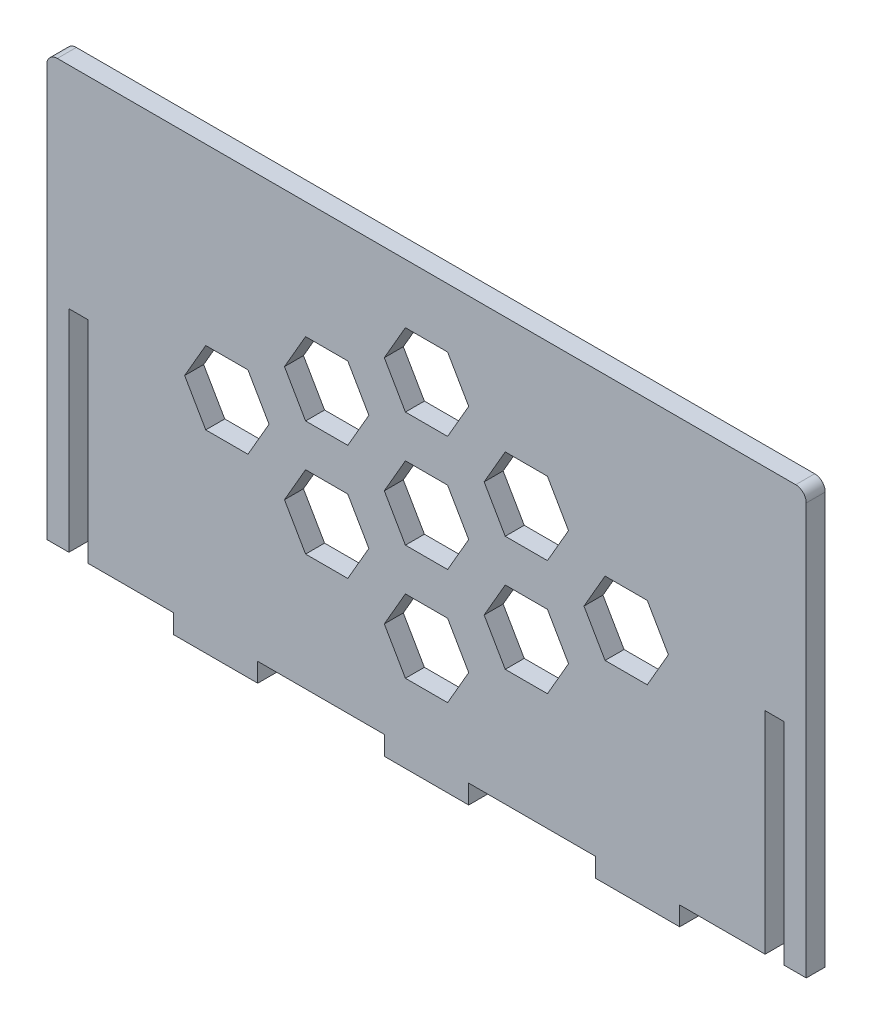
from build123d import *

# Parameters (mm, degrees)
SCHIZZO1_W                   = 720
SCHIZZO1_H                   = 400
ESTRUSIONE_ESTRUSIONE1_DEPTH = 18
SCHIZZO2_W                   = 80
SCHIZZO2_H                   = 18
ESTRUSIONE_ESTRUSIONE2_DEPTH = 18
SCHIZZO4_W                   = 18
SCHIZZO4_H                   = 200
TAGLIO_ESTRUSIONE1_DEPTH     = 18
RACCORDO1_R                  = 10
TAGLIO_ESTRUSIONE2_DEPTH     = 18


with BuildPart() as part:
    # Schizzo1 → Estrusione-Estrusione1 (new body)
    with BuildSketch(Plane.XY):
        Rectangle(SCHIZZO1_W, SCHIZZO1_H)
    extrude(amount=ESTRUSIONE_ESTRUSIONE1_DEPTH)

    # Schizzo2 → Estrusione-Estrusione2 (add)
    with BuildSketch(Plane.XY.offset(18)):
        with Locations((0, -209)):
            Rectangle(SCHIZZO2_W, SCHIZZO2_H)
        with Locations((-200, -209)):
            Rectangle(SCHIZZO2_W, SCHIZZO2_H)
        with Locations((200, -209)):
            Rectangle(SCHIZZO2_W, SCHIZZO2_H)
    extrude(amount=-ESTRUSIONE_ESTRUSIONE2_DEPTH)

    # Schizzo4 → Taglio-Estrusione1 (cut)
    with BuildSketch(Plane.XY.offset(18)):
        with Locations((-330, -100)):
            Rectangle(SCHIZZO4_W, SCHIZZO4_H)
        with Locations((330, -100)):
            Rectangle(SCHIZZO4_W, SCHIZZO4_H)
    extrude(amount=-TAGLIO_ESTRUSIONE1_DEPTH, mode=Mode.SUBTRACT)

    # Raccordo1
    raccordo1_edges = [part.edges().sort_by_distance(p)[0] for p in [
        (-360, 200, 9),
        (360, 200, 9),
    ]]
    fillet(raccordo1_edges, radius=RACCORDO1_R)

    # Schizzo5 → Taglio-Estrusione2 (cut)
    with BuildSketch(Plane.XY.offset(18)):
        Polygon((40, 0), (20, 34.641016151), (-20, 34.641016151), (-40, 0), (-20, -34.641016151), (20, -34.641016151), align=None)
        Polygon((74.641016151, 20), (114.641016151, 20), (134.641016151, 54.641016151), (114.641016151, 89.282032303), (74.641016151, 89.282032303), (54.641016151, 54.641016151), align=None)
        Polygon((54.641016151, -54.641016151), (74.641016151, -20), (114.641016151, -20), (134.641016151, -54.641016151), (114.641016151, -89.282032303), (74.641016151, -89.282032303), align=None)
        Polygon((20, 143.923048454), (40, 109.282032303), (20, 74.641016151), (-20, 74.641016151), (-40, 109.282032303), (-20, 143.923048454), align=None)
        Polygon((20, -74.641016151), (40, -109.282032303), (20, -143.923048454), (-20, -143.923048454), (-40, -109.282032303), (-20, -74.641016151), align=None)
        Polygon((-74.641016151, -20), (-114.641016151, -20), (-134.641016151, -54.641016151), (-114.641016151, -89.282032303), (-74.641016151, -89.282032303), (-54.641016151, -54.641016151), align=None)
        Polygon((-54.641016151, 54.641016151), (-74.641016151, 20), (-114.641016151, 20), (-134.641016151, 54.641016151), (-114.641016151, 89.282032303), (-74.641016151, 89.282032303), align=None)
        Polygon((-209.282032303, -34.641016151), (-229.282032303, 0), (-209.282032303, 34.641016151), (-169.282032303, 34.641016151), (-149.282032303, 0), (-169.282032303, -34.641016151), align=None)
        Polygon((169.282032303, -34.641016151), (149.282032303, 0), (169.282032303, 34.641016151), (209.282032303, 34.641016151), (229.282032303, 0), (209.282032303, -34.641016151), align=None)
    extrude(amount=-TAGLIO_ESTRUSIONE2_DEPTH, mode=Mode.SUBTRACT)


solid = part.part
